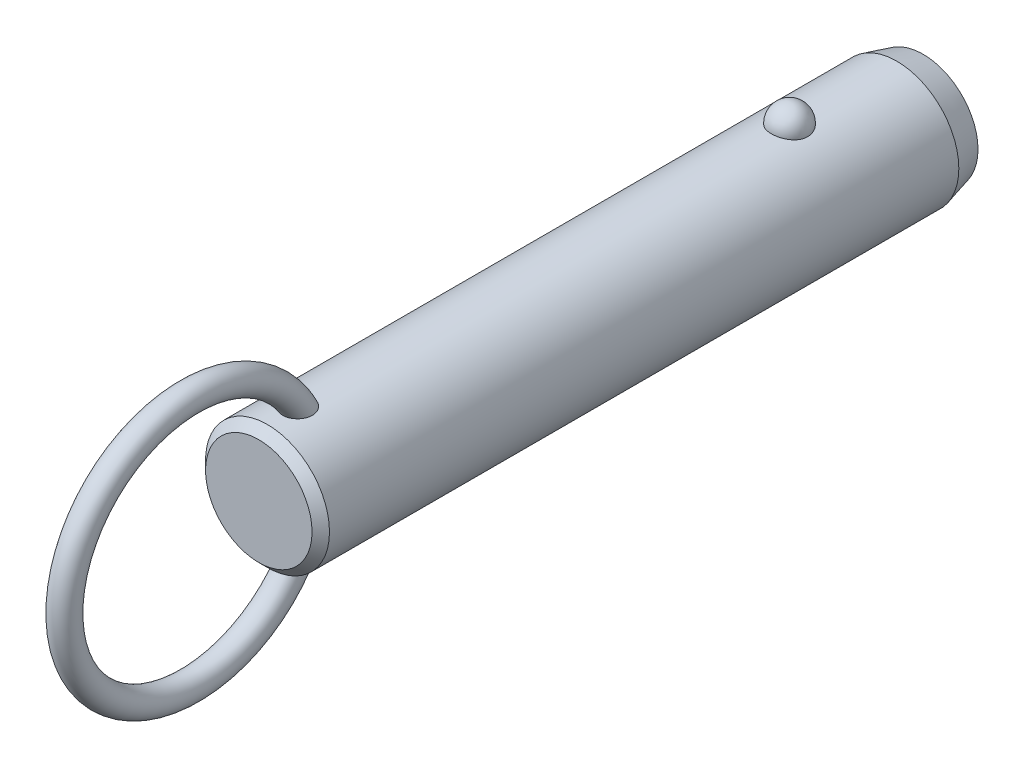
ISO-10303-21;
HEADER;
FILE_DESCRIPTION(('STEP AP214'),'2;1');
FILE_NAME('part.step','',(''),(''),'','','');
FILE_SCHEMA(('AUTOMOTIVE_DESIGN { 1 0 10303 214 1 1 1 1 }'));
ENDSEC;
DATA;
#1=APPLICATION_CONTEXT('core data for automotive mechanical design processes');
#2=APPLICATION_PROTOCOL_DEFINITION('international standard','automotive_design',2000,#1);
#3=PRODUCT_CONTEXT('',#1,'mechanical');
#4=PRODUCT('Part','Part','',(#3));
#5=PRODUCT_RELATED_PRODUCT_CATEGORY('part','',(#4));
#6=PRODUCT_DEFINITION_FORMATION('','',#4);
#7=PRODUCT_DEFINITION_CONTEXT('part definition',#1,'design');
#8=PRODUCT_DEFINITION('design','',#6,#7);
#9=PRODUCT_DEFINITION_SHAPE('','',#8);
#10=(LENGTH_UNIT() NAMED_UNIT(*) SI_UNIT(.MILLI.,.METRE.));
#11=(NAMED_UNIT(*) PLANE_ANGLE_UNIT() SI_UNIT($,.RADIAN.));
#12=(NAMED_UNIT(*) SI_UNIT($,.STERADIAN.) SOLID_ANGLE_UNIT());
#13=UNCERTAINTY_MEASURE_WITH_UNIT(LENGTH_MEASURE(1.E-05),#10,'distance_accuracy_value','');
#14=(GEOMETRIC_REPRESENTATION_CONTEXT(3) GLOBAL_UNCERTAINTY_ASSIGNED_CONTEXT((#13)) GLOBAL_UNIT_ASSIGNED_CONTEXT((#10,
#11,#12)) REPRESENTATION_CONTEXT('',''));
#15=CARTESIAN_POINT('',(0.,0.,0.));
#16=DIRECTION('',(0.,0.,1.));
#17=DIRECTION('',(1.,0.,0.));
#18=AXIS2_PLACEMENT_3D('',#15,#16,#17);
#19=CARTESIAN_POINT('',(0.,0.,50.8));
#20=DIRECTION('',(0.,0.,-1.));
#21=DIRECTION('',(-1.,0.,0.));
#22=AXIS2_PLACEMENT_3D('',#19,#20,#21);
#23=CYLINDRICAL_SURFACE('',#22,7.1);
#24=CARTESIAN_POINT('',(2.0769088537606,6.78943661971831,-2.1));
#25=CARTESIAN_POINT('',(2.07690739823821,6.78943796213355,-1.98268154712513));
#26=CARTESIAN_POINT('',(2.06738130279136,6.79237331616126,-1.86534506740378));
#27=CARTESIAN_POINT('',(2.0295040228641,6.8037853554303,-1.63400788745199));
#28=CARTESIAN_POINT('',(2.00114757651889,6.81226358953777,-1.52000812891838));
#29=CARTESIAN_POINT('',(1.92632025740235,6.83379798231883,-1.29863433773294));
#30=CARTESIAN_POINT('',(1.87985726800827,6.84685214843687,-1.19125744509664));
#31=CARTESIAN_POINT('',(1.76995205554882,6.87608091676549,-0.98604657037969));
#32=CARTESIAN_POINT('',(1.70650980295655,6.8922555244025,-0.88821260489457));
#33=CARTESIAN_POINT('',(1.5638119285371,6.92602930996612,-0.704242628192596));
#34=CARTESIAN_POINT('',(1.4844714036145,6.94363582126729,-0.618173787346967));
#35=CARTESIAN_POINT('',(1.31221746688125,6.97823658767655,-0.460740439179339));
#36=CARTESIAN_POINT('',(1.21930409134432,6.99523084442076,-0.389375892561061));
#37=CARTESIAN_POINT('',(1.02268781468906,7.02666176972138,-0.263547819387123));
#38=CARTESIAN_POINT('',(0.91902009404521,7.04110638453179,-0.209031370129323));
#39=CARTESIAN_POINT('',(0.703548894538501,7.06588726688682,-0.118163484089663));
#40=CARTESIAN_POINT('',(0.591746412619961,7.07622403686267,-0.0818098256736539));
#41=CARTESIAN_POINT('',(0.365557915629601,7.09147068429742,-0.0288711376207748));
#42=CARTESIAN_POINT('',(0.251267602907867,7.09648447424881,-0.0119070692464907));
#43=CARTESIAN_POINT('',(0.0213499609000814,7.10089837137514,0.00304925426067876));
#44=CARTESIAN_POINT('',(-0.0942772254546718,7.10029907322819,0.00104351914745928));
#45=CARTESIAN_POINT('',(-0.321651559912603,7.09360829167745,-0.0216931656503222));
#46=CARTESIAN_POINT('',(-0.433431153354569,7.08760388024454,-0.0421272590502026));
#47=CARTESIAN_POINT('',(-0.651862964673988,7.07086131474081,-0.100729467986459));
#48=CARTESIAN_POINT('',(-0.758515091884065,7.06012307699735,-0.138897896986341));
#49=CARTESIAN_POINT('',(-0.964449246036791,7.03496097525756,-0.232213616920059));
#50=CARTESIAN_POINT('',(-1.06368095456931,7.02051445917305,-0.287465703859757));
#51=CARTESIAN_POINT('',(-1.25145353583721,6.98948740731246,-0.413383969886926));
#52=CARTESIAN_POINT('',(-1.33999321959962,6.97290663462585,-0.48405186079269));
#53=CARTESIAN_POINT('',(-1.50591604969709,6.93898770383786,-0.640594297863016));
#54=CARTESIAN_POINT('',(-1.58302488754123,6.92164094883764,-0.726757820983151));
#55=CARTESIAN_POINT('',(-1.72189320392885,6.8884103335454,-0.91092752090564));
#56=CARTESIAN_POINT('',(-1.78365144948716,6.87252659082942,-1.008934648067));
#57=CARTESIAN_POINT('',(-1.89101272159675,6.84377189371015,-1.21549497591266));
#58=CARTESIAN_POINT('',(-1.93639553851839,6.83094274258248,-1.32416860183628));
#59=CARTESIAN_POINT('',(-2.00874275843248,6.81002070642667,-1.54791500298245));
#60=CARTESIAN_POINT('',(-2.03570774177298,6.80192767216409,-1.66298757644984));
#61=CARTESIAN_POINT('',(-2.07047276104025,6.7914266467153,-1.89571453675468));
#62=CARTESIAN_POINT('',(-2.07835878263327,6.78899315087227,-2.01335491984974));
#63=CARTESIAN_POINT('',(-2.07502083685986,6.79001409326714,-2.24833570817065));
#64=CARTESIAN_POINT('',(-2.06379746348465,6.7934683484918,-2.36567612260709));
#65=CARTESIAN_POINT('',(-2.02263913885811,6.80583442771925,-2.59603194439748));
#66=CARTESIAN_POINT('',(-1.99281127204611,6.81471501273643,-2.70906820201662));
#67=CARTESIAN_POINT('',(-1.91526639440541,6.83691232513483,-2.92836575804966));
#68=CARTESIAN_POINT('',(-1.8675486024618,6.85022924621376,-3.03462676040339));
#69=CARTESIAN_POINT('',(-1.75504492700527,6.87991336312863,-3.23806487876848));
#70=CARTESIAN_POINT('',(-1.69015924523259,6.89629822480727,-3.33518422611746));
#71=CARTESIAN_POINT('',(-1.54505404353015,6.93024852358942,-3.51697105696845));
#72=CARTESIAN_POINT('',(-1.46483385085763,6.94781401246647,-3.60163799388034));
#73=CARTESIAN_POINT('',(-1.29071406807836,6.98225977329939,-3.75654119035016));
#74=CARTESIAN_POINT('',(-1.19675650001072,6.99913673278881,-3.82671308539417));
#75=CARTESIAN_POINT('',(-0.997940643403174,7.03023618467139,-3.9501837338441));
#76=CARTESIAN_POINT('',(-0.89308318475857,7.04445887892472,-4.00348377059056));
#77=CARTESIAN_POINT('',(-0.676902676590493,7.06848365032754,-4.09107242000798));
#78=CARTESIAN_POINT('',(-0.565686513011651,7.0783430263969,-4.12560889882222));
#79=CARTESIAN_POINT('',(-0.338739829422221,7.09282534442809,-4.17575450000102));
#80=CARTESIAN_POINT('',(-0.223009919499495,7.09744899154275,-4.19136617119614));
#81=CARTESIAN_POINT('',(0.00707628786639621,7.10090930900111,-4.20307965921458));
#82=CARTESIAN_POINT('',(0.121410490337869,7.09986531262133,-4.19958377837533));
#83=CARTESIAN_POINT('',(0.347815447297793,7.092380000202,-4.17411564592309));
#84=CARTESIAN_POINT('',(0.459886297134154,7.08593891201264,-4.15214417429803));
#85=CARTESIAN_POINT('',(0.678084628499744,7.06838983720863,-4.09049562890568));
#86=CARTESIAN_POINT('',(0.784237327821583,7.05730369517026,-4.05090137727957));
#87=CARTESIAN_POINT('',(0.988305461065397,7.03163139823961,-3.95511447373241));
#88=CARTESIAN_POINT('',(1.08622031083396,7.01704499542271,-3.89892064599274));
#89=CARTESIAN_POINT('',(1.27284490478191,6.98562668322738,-3.77035541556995));
#90=CARTESIAN_POINT('',(1.36137372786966,6.96876135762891,-3.69772964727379));
#91=CARTESIAN_POINT('',(1.52509486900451,6.93477412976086,-3.53878279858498));
#92=CARTESIAN_POINT('',(1.60028496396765,6.91765218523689,-3.45245943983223));
#93=CARTESIAN_POINT('',(1.73681688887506,6.88465753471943,-3.26658774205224));
#94=CARTESIAN_POINT('',(1.79785966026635,6.86881574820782,-3.16681408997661));
#95=CARTESIAN_POINT('',(1.90265327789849,6.84053157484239,-2.95814408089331));
#96=CARTESIAN_POINT('',(1.94640861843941,6.82808830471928,-2.84925010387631));
#97=CARTESIAN_POINT('',(2.01274378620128,6.80881460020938,-2.63454318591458));
#98=CARTESIAN_POINT('',(2.03676193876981,6.80160856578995,-2.52920574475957));
#99=CARTESIAN_POINT('',(2.06884490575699,6.79191902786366,-2.3159172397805));
#100=CARTESIAN_POINT('',(2.07691019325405,6.78943538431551,-2.20796625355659));
#101=CARTESIAN_POINT('',(2.0769088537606,6.78943661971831,-2.1));
#102=B_SPLINE_CURVE_WITH_KNOTS('',3,(#24,#25,#26,#27,#28,#29,#30,#31,#32,#33,#34,#35,#36,#37,
#38,#39,#40,#41,#42,#43,#44,#45,#46,#47,#48,#49,#50,#51,#52,#53,#54,#55,#56,#57,#58,#59,#60,#61,
#62,#63,#64,#65,#66,#67,#68,#69,#70,#71,#72,#73,#74,#75,#76,#77,#78,#79,#80,#81,#82,#83,#84,#85,
#86,#87,#88,#89,#90,#91,#92,#93,#94,#95,#96,#97,#98,#99,#100,#101),.UNSPECIFIED.,.T.,.F.,(4,2,2,
2,2,2,2,2,2,2,2,2,2,2,2,2,2,2,2,2,2,2,2,2,2,2,2,2,2,2,2,2,2,2,2,2,2,2,4),(0.,0.351568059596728,
0.703234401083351,1.05474780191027,1.40626181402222,1.75970563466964,2.11314851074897,
2.4654696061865,2.81774759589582,3.16301449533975,3.50824481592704,3.84801136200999,
4.18778391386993,4.52968352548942,4.87162112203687,5.22076181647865,5.56993054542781,
5.92363364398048,6.27732559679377,6.62942052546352,6.98150450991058,7.33158042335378,
7.68167162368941,8.03384443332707,8.38603269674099,8.73975272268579,9.09344583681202,
9.44234545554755,9.79119807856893,10.1327344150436,10.4742563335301,10.8141898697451,
11.1541474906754,11.4997793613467,11.8454687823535,12.1979079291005,12.5502553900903,
12.8738073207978,13.1973496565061),.UNSPECIFIED.);
#103=CARTESIAN_POINT('',(2.0769088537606,6.78943661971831,-2.1));
#104=VERTEX_POINT('',#103);
#105=EDGE_CURVE('E41',#104,#104,#102,.T.);
#106=ORIENTED_EDGE('',*,*,#105,.T.);
#107=EDGE_LOOP('',(#106));
#108=FACE_BOUND('',#107,.T.);
#109=CARTESIAN_POINT('',(0.,0.,57.72));
#110=DIRECTION('',(0.,0.,1.));
#111=DIRECTION('',(1.,0.,0.));
#112=AXIS2_PLACEMENT_3D('',#109,#110,#111);
#113=CIRCLE('',#112,7.1);
#114=CARTESIAN_POINT('',(7.1,0.,57.72));
#115=VERTEX_POINT('',#114);
#116=EDGE_CURVE('E10',#115,#115,#113,.F.);
#117=ORIENTED_EDGE('',*,*,#116,.T.);
#118=EDGE_LOOP('',(#117));
#119=FACE_BOUND('',#118,.T.);
#120=CARTESIAN_POINT('',(-0.429539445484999,-7.08699541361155,52.5429212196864));
#121=CARTESIAN_POINT('',(-0.508331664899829,-7.08221999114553,52.5668764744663));
#122=CARTESIAN_POINT('',(-0.585039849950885,-7.07624016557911,52.5974570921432));
#123=CARTESIAN_POINT('',(-0.732082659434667,-7.06254296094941,52.6710242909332));
#124=CARTESIAN_POINT('',(-0.802417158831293,-7.05482554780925,52.7140111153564));
#125=CARTESIAN_POINT('',(-0.934722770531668,-7.03851844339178,52.8111135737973));
#126=CARTESIAN_POINT('',(-0.99670020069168,-7.02992941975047,52.8652207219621));
#127=CARTESIAN_POINT('',(-1.11079942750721,-7.01280697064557,52.9829676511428));
#128=CARTESIAN_POINT('',(-1.16292136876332,-7.00427354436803,53.0466072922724));
#129=CARTESIAN_POINT('',(-1.25705660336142,-6.98799959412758,53.1826870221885));
#130=CARTESIAN_POINT('',(-1.29888032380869,-6.98027525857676,53.2552598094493));
#131=CARTESIAN_POINT('',(-1.37069920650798,-6.96652886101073,53.4061686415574));
#132=CARTESIAN_POINT('',(-1.40069157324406,-6.96050720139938,53.4845060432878));
#133=CARTESIAN_POINT('',(-1.45043507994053,-6.95031881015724,53.6501903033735));
#134=CARTESIAN_POINT('',(-1.46937115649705,-6.94630231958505,53.7377897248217));
#135=CARTESIAN_POINT('',(-1.49424917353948,-6.94099239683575,53.9148714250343));
#136=CARTESIAN_POINT('',(-1.50018601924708,-6.93970003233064,54.0043544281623));
#137=CARTESIAN_POINT('',(-1.49978214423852,-6.93978815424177,54.1940607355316));
#138=CARTESIAN_POINT('',(-1.49187639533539,-6.94150934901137,54.294279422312));
#139=CARTESIAN_POINT('',(-1.46177925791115,-6.94790814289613,54.4924798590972));
#140=CARTESIAN_POINT('',(-1.43957541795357,-6.95258831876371,54.590459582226));
#141=CARTESIAN_POINT('',(-1.37783293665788,-6.96510647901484,54.7953629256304));
#142=CARTESIAN_POINT('',(-1.33634073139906,-6.97328848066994,54.9016801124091));
#143=CARTESIAN_POINT('',(-1.23686994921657,-6.99161706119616,55.1061777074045));
#144=CARTESIAN_POINT('',(-1.17889192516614,-7.00176357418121,55.2043583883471));
#145=CARTESIAN_POINT('',(-1.0587512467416,-7.02082898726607,55.372374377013));
#146=CARTESIAN_POINT('',(-0.999247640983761,-7.02963746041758,55.4441230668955));
#147=CARTESIAN_POINT('',(-0.869494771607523,-7.04686074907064,55.5771959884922));
#148=CARTESIAN_POINT('',(-0.799263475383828,-7.05527619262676,55.6385372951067));
#149=CARTESIAN_POINT('',(-0.665408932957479,-7.06899457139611,55.7351316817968));
#150=CARTESIAN_POINT('',(-0.603817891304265,-7.07457275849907,55.7731512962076));
#151=CARTESIAN_POINT('',(-0.475172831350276,-7.08437420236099,55.8387581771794));
#152=CARTESIAN_POINT('',(-0.408123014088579,-7.08859848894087,55.8663533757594));
#153=CARTESIAN_POINT('',(-0.269431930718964,-7.09522749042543,55.9092569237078));
#154=CARTESIAN_POINT('',(-0.197757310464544,-7.09761688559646,55.9244618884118));
#155=CARTESIAN_POINT('',(-0.052784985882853,-7.10017268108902,55.9407168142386));
#156=CARTESIAN_POINT('',(0.0205115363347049,-7.10034065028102,55.9417767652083));
#157=CARTESIAN_POINT('',(0.156426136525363,-7.09855986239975,55.9304619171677));
#158=CARTESIAN_POINT('',(0.219199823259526,-7.09688191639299,55.9198060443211));
#159=CARTESIAN_POINT('',(0.342134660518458,-7.09201880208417,55.8885379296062));
#160=CARTESIAN_POINT('',(0.402295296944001,-7.08883333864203,55.8679237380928));
#161=CARTESIAN_POINT('',(0.520687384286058,-7.08113868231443,55.8172125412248));
#162=CARTESIAN_POINT('',(0.578791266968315,-7.07658958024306,55.7868272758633));
#163=CARTESIAN_POINT('',(0.690173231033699,-7.06659708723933,55.7183678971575));
#164=CARTESIAN_POINT('',(0.743447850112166,-7.061153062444,55.6802883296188));
#165=CARTESIAN_POINT('',(0.870947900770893,-7.04680292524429,55.5765929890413));
#166=CARTESIAN_POINT('',(0.941828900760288,-7.0375580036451,55.5068972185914));
#167=CARTESIAN_POINT('',(1.07136606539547,-7.01900793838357,55.3569450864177));
#168=CARTESIAN_POINT('',(1.13000013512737,-7.00970271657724,55.2766700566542));
#169=CARTESIAN_POINT('',(1.23579584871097,-6.99183327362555,55.1068997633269));
#170=CARTESIAN_POINT('',(1.28274271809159,-6.98328455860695,55.0172696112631));
#171=CARTESIAN_POINT('',(1.36351442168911,-6.96796352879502,54.8321763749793));
#172=CARTESIAN_POINT('',(1.39733971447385,-6.96119115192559,54.7367134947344));
#173=CARTESIAN_POINT('',(1.45579181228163,-6.94922464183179,54.5253092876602));
#174=CARTESIAN_POINT('',(1.47790145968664,-6.94449000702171,54.408631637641));
#175=CARTESIAN_POINT('',(1.50168752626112,-6.93938731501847,54.1730153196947));
#176=CARTESIAN_POINT('',(1.50336085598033,-6.93901991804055,54.0540763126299));
#177=CARTESIAN_POINT('',(1.48486516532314,-6.9430010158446,53.8236079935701));
#178=CARTESIAN_POINT('',(1.46573441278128,-6.9471253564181,53.7119958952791));
#179=CARTESIAN_POINT('',(1.40606892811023,-6.95944667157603,53.4948868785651));
#180=CARTESIAN_POINT('',(1.3655644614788,-6.96763788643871,53.3893815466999));
#181=CARTESIAN_POINT('',(1.27082700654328,-6.98548038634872,53.2042879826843));
#182=CARTESIAN_POINT('',(1.21949810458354,-6.99473841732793,53.1231719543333));
#183=CARTESIAN_POINT('',(1.10242050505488,-7.01414069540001,52.9722278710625));
#184=CARTESIAN_POINT('',(1.03668119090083,-7.02428436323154,52.9023925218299));
#185=CARTESIAN_POINT('',(0.900559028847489,-7.04295285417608,52.7835735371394));
#186=CARTESIAN_POINT('',(0.831428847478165,-7.05153466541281,52.7331573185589));
#187=CARTESIAN_POINT('',(0.685291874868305,-7.06723150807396,52.6451429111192));
#188=CARTESIAN_POINT('',(0.60828720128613,-7.0743469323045,52.6075412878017));
#189=CARTESIAN_POINT('',(0.451878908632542,-7.08602232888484,52.5474915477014));
#190=CARTESIAN_POINT('',(0.372686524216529,-7.09067127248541,52.5245088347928));
#191=CARTESIAN_POINT('',(0.211477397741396,-7.09730788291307,52.4920357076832));
#192=CARTESIAN_POINT('',(0.129460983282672,-7.09929585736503,52.4825437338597));
#193=CARTESIAN_POINT('',(-0.0332905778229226,-7.10037858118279,52.4773517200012));
#194=CARTESIAN_POINT('',(-0.1140163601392,-7.09953334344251,52.4813656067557));
#195=CARTESIAN_POINT('',(-0.273670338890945,-7.09517338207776,52.5024540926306));
#196=CARTESIAN_POINT('',(-0.352598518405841,-7.09165863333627,52.5195288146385));
#197=CARTESIAN_POINT('',(-0.429539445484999,-7.08699541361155,52.5429212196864));
#198=B_SPLINE_CURVE_WITH_KNOTS('',3,(#120,#121,#122,#123,#124,#125,#126,#127,#128,#129,#130,
#131,#132,#133,#134,#135,#136,#137,#138,#139,#140,#141,#142,#143,#144,#145,#146,#147,#148,#149,
#150,#151,#152,#153,#154,#155,#156,#157,#158,#159,#160,#161,#162,#163,#164,#165,#166,#167,#168,
#169,#170,#171,#172,#173,#174,#175,#176,#177,#178,#179,#180,#181,#182,#183,#184,#185,#186,#187,
#188,#189,#190,#191,#192,#193,#194,#195,#196,#197),.UNSPECIFIED.,.T.,.F.,(4,2,2,2,2,2,2,2,2,2,2,
2,2,2,2,2,2,2,2,2,2,2,2,2,2,2,2,2,2,2,2,2,2,2,2,2,2,2,4),(0.,0.247183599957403,
0.494372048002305,0.741372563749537,0.988369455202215,1.23962059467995,1.49093106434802,
1.75897818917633,2.02713035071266,2.32758265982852,2.62829697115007,2.9700873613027,
3.31186629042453,3.5917531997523,3.87117637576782,4.08813841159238,4.30493502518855,
4.52352259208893,4.7419557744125,4.93215328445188,5.12238804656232,5.31884850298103,
5.51544871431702,5.81332317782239,6.11173048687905,6.41527266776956,6.71880423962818,
7.07358156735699,7.42841252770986,7.76631485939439,8.10373999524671,8.39142246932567,
8.67891817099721,8.93560332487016,9.19221962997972,9.43881106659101,9.68537399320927,
9.92674752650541,10.1681233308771),.UNSPECIFIED.);
#199=CARTESIAN_POINT('',(-0.429539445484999,-7.08699541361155,52.5429212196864));
#200=VERTEX_POINT('',#199);
#201=EDGE_CURVE('E60',#200,#200,#198,.T.);
#202=ORIENTED_EDGE('',*,*,#201,.T.);
#203=EDGE_LOOP('',(#202));
#204=FACE_BOUND('',#203,.T.);
#205=CARTESIAN_POINT('',(-0.429539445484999,7.08699541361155,52.5429212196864));
#206=CARTESIAN_POINT('',(-0.351665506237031,7.09171429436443,52.5192469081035));
#207=CARTESIAN_POINT('',(-0.271733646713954,7.09525896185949,52.5020369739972));
#208=CARTESIAN_POINT('',(-0.110026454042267,7.09960839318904,52.4810059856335));
#209=CARTESIAN_POINT('',(-0.0282502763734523,7.10041187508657,52.477191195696));
#210=CARTESIAN_POINT('',(0.134782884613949,7.09918849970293,52.483059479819));
#211=CARTESIAN_POINT('',(0.216039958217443,7.09716214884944,52.4927401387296));
#212=CARTESIAN_POINT('',(0.375730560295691,7.09050177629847,52.5253471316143));
#213=CARTESIAN_POINT('',(0.454164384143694,7.08586802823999,52.5482720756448));
#214=CARTESIAN_POINT('',(0.606025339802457,7.07449911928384,52.606771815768));
#215=CARTESIAN_POINT('',(0.679451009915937,7.06776334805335,52.6423502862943));
#216=CARTESIAN_POINT('',(0.819234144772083,7.05292866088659,52.7251753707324));
#217=CARTESIAN_POINT('',(0.885591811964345,7.04482978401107,52.7724216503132));
#218=CARTESIAN_POINT('',(1.00993211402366,7.02808709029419,52.8775902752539));
#219=CARTESIAN_POINT('',(1.06785399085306,7.01943990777,52.935583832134));
#220=CARTESIAN_POINT('',(1.17342527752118,7.00256662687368,53.0603013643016));
#221=CARTESIAN_POINT('',(1.22107408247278,6.99434055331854,53.1270258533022));
#222=CARTESIAN_POINT('',(1.30652927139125,6.97889183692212,53.2693622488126));
#223=CARTESIAN_POINT('',(1.34399711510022,6.97170674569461,53.3451808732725));
#224=CARTESIAN_POINT('',(1.40682616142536,6.95930080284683,53.5018100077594));
#225=CARTESIAN_POINT('',(1.43218374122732,6.95408053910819,53.5826220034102));
#226=CARTESIAN_POINT('',(1.47246409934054,6.94566853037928,53.7535314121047));
#227=CARTESIAN_POINT('',(1.48642590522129,6.9426653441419,53.8438630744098));
#228=CARTESIAN_POINT('',(1.5011410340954,6.93949744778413,54.025619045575));
#229=CARTESIAN_POINT('',(1.50188917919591,6.93933385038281,54.1170437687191));
#230=CARTESIAN_POINT('',(1.49030464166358,6.94183245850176,54.3108438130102));
#231=CARTESIAN_POINT('',(1.47627413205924,6.94486147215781,54.413112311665));
#232=CARTESIAN_POINT('',(1.43356351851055,6.95380194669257,54.6144719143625));
#233=CARTESIAN_POINT('',(1.4048676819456,6.95971650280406,54.7135594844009));
#234=CARTESIAN_POINT('',(1.32908750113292,6.97461208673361,54.9189087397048));
#235=CARTESIAN_POINT('',(1.28011435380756,6.98388945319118,55.0244566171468));
#236=CARTESIAN_POINT('',(1.16520357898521,7.00397743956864,55.2257604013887));
#237=CARTESIAN_POINT('',(1.09927694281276,7.01478706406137,55.3215225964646));
#238=CARTESIAN_POINT('',(0.969361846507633,7.03373936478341,55.4767565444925));
#239=CARTESIAN_POINT('',(0.909042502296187,7.04187023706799,55.5393032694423));
#240=CARTESIAN_POINT('',(0.779178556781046,7.05741732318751,55.6540535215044));
#241=CARTESIAN_POINT('',(0.709649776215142,7.06483472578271,55.7062744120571));
#242=CARTESIAN_POINT('',(0.576854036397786,7.0767751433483,55.7881138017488));
#243=CARTESIAN_POINT('',(0.515118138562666,7.08158033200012,55.8201641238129));
#244=CARTESIAN_POINT('',(0.38712798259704,7.08972701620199,55.8737656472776));
#245=CARTESIAN_POINT('',(0.320877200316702,7.09306962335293,55.8953248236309));
#246=CARTESIAN_POINT('',(0.185041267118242,7.09791507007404,55.9264005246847));
#247=CARTESIAN_POINT('',(0.115437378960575,7.09940591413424,55.9358385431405));
#248=CARTESIAN_POINT('',(-0.0243157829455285,7.10030171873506,55.9415226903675));
#249=CARTESIAN_POINT('',(-0.0944648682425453,7.0997073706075,55.9377731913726));
#250=CARTESIAN_POINT('',(-0.225713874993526,7.09668414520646,55.9185081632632));
#251=CARTESIAN_POINT('',(-0.287006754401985,7.09444865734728,55.9042323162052));
#252=CARTESIAN_POINT('',(-0.406555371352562,7.08860360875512,55.8663685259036));
#253=CARTESIAN_POINT('',(-0.464809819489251,7.08499346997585,55.8427766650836));
#254=CARTESIAN_POINT('',(-0.594955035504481,7.07541654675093,55.7789232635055));
#255=CARTESIAN_POINT('',(-0.66538935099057,7.06906574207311,55.735753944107));
#256=CARTESIAN_POINT('',(-0.798242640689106,7.05530261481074,55.638587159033));
#257=CARTESIAN_POINT('',(-0.860645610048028,7.0478882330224,55.5845686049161));
#258=CARTESIAN_POINT('',(-0.994249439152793,7.03045217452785,55.4509965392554));
#259=CARTESIAN_POINT('',(-1.06260129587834,7.02030745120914,55.3686143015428));
#260=CARTESIAN_POINT('',(-1.18502045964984,7.00068382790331,55.193843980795));
#261=CARTESIAN_POINT('',(-1.23907684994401,6.99120544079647,55.101448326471));
#262=CARTESIAN_POINT('',(-1.33335589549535,6.97384343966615,54.9080085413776));
#263=CARTESIAN_POINT('',(-1.37336138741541,6.96598557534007,54.8068564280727));
#264=CARTESIAN_POINT('',(-1.43770677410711,6.9529905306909,54.5995046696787));
#265=CARTESIAN_POINT('',(-1.46204473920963,6.94785368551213,54.49330440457));
#266=CARTESIAN_POINT('',(-1.49537533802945,6.94076296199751,54.2682317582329));
#267=CARTESIAN_POINT('',(-1.50273564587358,6.93914842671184,54.1490975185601));
#268=CARTESIAN_POINT('',(-1.4954555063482,6.94072368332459,53.9114703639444));
#269=CARTESIAN_POINT('',(-1.48082914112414,6.94391040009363,53.7929770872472));
#270=CARTESIAN_POINT('',(-1.43076401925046,6.95438579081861,53.5734325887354));
#271=CARTESIAN_POINT('',(-1.39762227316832,6.96121852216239,53.4718413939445));
#272=CARTESIAN_POINT('',(-1.31211274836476,6.97783941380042,53.2773513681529));
#273=CARTESIAN_POINT('',(-1.2597660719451,6.98762432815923,53.1844431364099));
#274=CARTESIAN_POINT('',(-1.14583073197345,7.00713153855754,53.0241601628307));
#275=CARTESIAN_POINT('',(-1.08665947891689,7.01665982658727,52.9550351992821));
#276=CARTESIAN_POINT('',(-0.956606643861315,7.03556646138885,52.8288786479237));
#277=CARTESIAN_POINT('',(-0.885737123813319,7.04494495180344,52.7718347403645));
#278=CARTESIAN_POINT('',(-0.751558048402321,7.06035735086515,52.6831004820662));
#279=CARTESIAN_POINT('',(-0.690120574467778,7.0666695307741,52.6485932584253));
#280=CARTESIAN_POINT('',(-0.562815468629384,7.07794609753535,52.5887507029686));
#281=CARTESIAN_POINT('',(-0.496948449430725,7.08291067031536,52.5634141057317));
#282=CARTESIAN_POINT('',(-0.429539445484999,7.08699541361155,52.5429212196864));
#283=B_SPLINE_CURVE_WITH_KNOTS('',3,(#205,#206,#207,#208,#209,#210,#211,#212,#213,#214,#215,
#216,#217,#218,#219,#220,#221,#222,#223,#224,#225,#226,#227,#228,#229,#230,#231,#232,#233,#234,
#235,#236,#237,#238,#239,#240,#241,#242,#243,#244,#245,#246,#247,#248,#249,#250,#251,#252,#253,
#254,#255,#256,#257,#258,#259,#260,#261,#262,#263,#264,#265,#266,#267,#268,#269,#270,#271,#272,
#273,#274,#275,#276,#277,#278,#279,#280,#281,#282),.UNSPECIFIED.,.T.,.F.,(4,2,2,2,2,2,2,2,2,2,2,
2,2,2,2,2,2,2,2,2,2,2,2,2,2,2,2,2,2,2,2,2,2,2,2,2,2,2,4),(0.,0.244335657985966,
0.488785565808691,0.733191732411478,0.977572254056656,1.22202379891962,1.46646834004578,
1.71259457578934,1.9587352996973,2.21226768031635,2.46587585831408,2.7391381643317,
3.01250754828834,3.32109936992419,3.63002293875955,3.97863512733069,4.32702187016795,
4.58793945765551,4.84841449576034,5.05676704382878,5.26496096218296,5.47449661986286,
5.68396281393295,5.8720544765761,6.06022532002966,6.30743751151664,6.55513496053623,
6.87602468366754,7.19715875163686,7.52305774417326,7.84899686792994,8.20516155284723,
8.56109821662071,8.8804008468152,9.19935367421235,9.47236282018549,9.74509220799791,
9.95662250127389,10.1681235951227),.UNSPECIFIED.);
#284=CARTESIAN_POINT('',(-0.429539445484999,7.08699541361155,52.5429212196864));
#285=VERTEX_POINT('',#284);
#286=EDGE_CURVE('E67',#285,#285,#283,.T.);
#287=ORIENTED_EDGE('',*,*,#286,.T.);
#288=EDGE_LOOP('',(#287));
#289=FACE_BOUND('',#288,.T.);
#290=CARTESIAN_POINT('',(0.,0.,-14.3999999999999));
#291=DIRECTION('',(0.,0.,-1.));
#292=DIRECTION('',(-1.,0.,0.));
#293=AXIS2_PLACEMENT_3D('',#290,#291,#292);
#294=CIRCLE('',#293,7.1);
#295=CARTESIAN_POINT('',(7.1,0.,-14.3999999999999));
#296=VERTEX_POINT('',#295);
#297=EDGE_CURVE('E57',#296,#296,#294,.F.);
#298=ORIENTED_EDGE('',*,*,#297,.T.);
#299=EDGE_LOOP('',(#298));
#300=FACE_BOUND('',#299,.T.);
#301=ADVANCED_FACE('F37',(#108,#119,#204,#289,#300),#23,.T.);
#302=CARTESIAN_POINT('',(0.,0.,-17.4));
#303=DIRECTION('',(0.,0.,-1.));
#304=DIRECTION('',(-1.,0.,0.));
#305=AXIS2_PLACEMENT_3D('',#302,#303,#304);
#306=PLANE('',#305);
#307=CARTESIAN_POINT('',(0.,0.,-17.4));
#308=DIRECTION('',(0.,0.,-1.));
#309=DIRECTION('',(-1.,0.,0.));
#310=AXIS2_PLACEMENT_3D('',#307,#308,#309);
#311=CIRCLE('',#310,6.29615242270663);
#312=CARTESIAN_POINT('',(6.29615242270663,0.,-17.4));
#313=VERTEX_POINT('',#312);
#314=EDGE_CURVE('E66',#313,#313,#311,.T.);
#315=ORIENTED_EDGE('',*,*,#314,.T.);
#316=EDGE_LOOP('',(#315));
#317=FACE_BOUND('',#316,.T.);
#318=ADVANCED_FACE('F85',(#317),#306,.T.);
#319=CARTESIAN_POINT('',(0.,0.,-17.4));
#320=DIRECTION('',(0.,0.,1.));
#321=DIRECTION('',(1.,0.,0.));
#322=AXIS2_PLACEMENT_3D('',#319,#320,#321);
#323=CONICAL_SURFACE('',#322,6.29615242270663,0.261799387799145);
#324=CARTESIAN_POINT('',(7.1,0.,-14.3999999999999));
#325=CARTESIAN_POINT('',(7.09162658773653,0.,-14.4312499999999));
#326=CARTESIAN_POINT('',(7.08325317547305,0.,-14.4624999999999));
#327=CARTESIAN_POINT('',(7.06650635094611,0.,-14.5249999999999));
#328=CARTESIAN_POINT('',(7.05813293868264,0.,-14.5562499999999));
#329=CARTESIAN_POINT('',(7.04138611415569,0.,-14.6187499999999));
#330=CARTESIAN_POINT('',(7.03301270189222,0.,-14.6499999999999));
#331=CARTESIAN_POINT('',(7.01626587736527,0.,-14.7124999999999));
#332=CARTESIAN_POINT('',(7.0078924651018,0.,-14.7437499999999));
#333=CARTESIAN_POINT('',(6.99114564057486,0.,-14.8062499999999));
#334=CARTESIAN_POINT('',(6.98277222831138,0.,-14.8374999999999));
#335=CARTESIAN_POINT('',(6.96602540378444,0.,-14.8999999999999));
#336=CARTESIAN_POINT('',(6.95765199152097,0.,-14.9312499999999));
#337=CARTESIAN_POINT('',(6.94090516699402,0.,-14.9937499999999));
#338=CARTESIAN_POINT('',(6.93253175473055,0.,-15.0249999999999));
#339=CARTESIAN_POINT('',(6.9157849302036,0.,-15.0874999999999));
#340=CARTESIAN_POINT('',(6.90741151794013,0.,-15.1187499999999));
#341=CARTESIAN_POINT('',(6.89066469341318,0.,-15.1812499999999));
#342=CARTESIAN_POINT('',(6.88229128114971,0.,-15.2124999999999));
#343=CARTESIAN_POINT('',(6.86554445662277,0.,-15.2749999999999));
#344=CARTESIAN_POINT('',(6.85717104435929,0.,-15.3062499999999));
#345=CARTESIAN_POINT('',(6.84042421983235,0.,-15.3687499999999));
#346=CARTESIAN_POINT('',(6.83205080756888,0.,-15.4));
#347=CARTESIAN_POINT('',(6.81530398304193,0.,-15.4625));
#348=CARTESIAN_POINT('',(6.80693057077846,0.,-15.49375));
#349=CARTESIAN_POINT('',(6.79018374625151,0.,-15.55625));
#350=CARTESIAN_POINT('',(6.78181033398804,0.,-15.5875));
#351=CARTESIAN_POINT('',(6.7650635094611,0.,-15.65));
#352=CARTESIAN_POINT('',(6.75669009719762,0.,-15.68125));
#353=CARTESIAN_POINT('',(6.73994327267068,0.,-15.74375));
#354=CARTESIAN_POINT('',(6.7315698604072,0.,-15.775));
#355=CARTESIAN_POINT('',(6.71482303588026,0.,-15.8375));
#356=CARTESIAN_POINT('',(6.70644962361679,0.,-15.86875));
#357=CARTESIAN_POINT('',(6.68970279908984,0.,-15.93125));
#358=CARTESIAN_POINT('',(6.68132938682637,0.,-15.9625));
#359=CARTESIAN_POINT('',(6.66458256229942,0.,-16.025));
#360=CARTESIAN_POINT('',(6.65620915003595,0.,-16.05625));
#361=CARTESIAN_POINT('',(6.639462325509,0.,-16.11875));
#362=CARTESIAN_POINT('',(6.63108891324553,0.,-16.15));
#363=CARTESIAN_POINT('',(6.61434208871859,0.,-16.2125));
#364=CARTESIAN_POINT('',(6.60596867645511,0.,-16.24375));
#365=CARTESIAN_POINT('',(6.58922185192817,0.,-16.30625));
#366=CARTESIAN_POINT('',(6.5808484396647,0.,-16.3375));
#367=CARTESIAN_POINT('',(6.56410161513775,0.,-16.4));
#368=CARTESIAN_POINT('',(6.55572820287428,0.,-16.43125));
#369=CARTESIAN_POINT('',(6.53898137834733,0.,-16.49375));
#370=CARTESIAN_POINT('',(6.53060796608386,0.,-16.525));
#371=CARTESIAN_POINT('',(6.51386114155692,0.,-16.5875));
#372=CARTESIAN_POINT('',(6.50548772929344,0.,-16.61875));
#373=CARTESIAN_POINT('',(6.4887409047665,0.,-16.68125));
#374=CARTESIAN_POINT('',(6.48036749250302,0.,-16.7125));
#375=CARTESIAN_POINT('',(6.46362066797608,0.,-16.775));
#376=CARTESIAN_POINT('',(6.45524725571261,0.,-16.80625));
#377=CARTESIAN_POINT('',(6.43850043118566,0.,-16.86875));
#378=CARTESIAN_POINT('',(6.43012701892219,0.,-16.9));
#379=CARTESIAN_POINT('',(6.41338019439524,0.,-16.9625));
#380=CARTESIAN_POINT('',(6.40500678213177,0.,-16.99375));
#381=CARTESIAN_POINT('',(6.38825995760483,0.,-17.05625));
#382=CARTESIAN_POINT('',(6.37988654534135,0.,-17.0875));
#383=CARTESIAN_POINT('',(6.36313972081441,0.,-17.15));
#384=CARTESIAN_POINT('',(6.35476630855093,0.,-17.18125));
#385=CARTESIAN_POINT('',(6.33801948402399,0.,-17.24375));
#386=CARTESIAN_POINT('',(6.32964607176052,0.,-17.275));
#387=CARTESIAN_POINT('',(6.31289924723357,0.,-17.3375));
#388=CARTESIAN_POINT('',(6.3045258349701,0.,-17.36875));
#389=CARTESIAN_POINT('',(6.29615242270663,0.,-17.4));
#390=B_SPLINE_CURVE_WITH_KNOTS('',3,(#324,#325,#326,#327,#328,#329,#330,#331,#332,#333,#334,
#335,#336,#337,#338,#339,#340,#341,#342,#343,#344,#345,#346,#347,#348,#349,#350,#351,#352,#353,
#354,#355,#356,#357,#358,#359,#360,#361,#362,#363,#364,#365,#366,#367,#368,#369,#370,#371,#372,
#373,#374,#375,#376,#377,#378,#379,#380,#381,#382,#383,#384,#385,#386,#387,#388,#389),
.UNSPECIFIED.,.F.,.F.,(4,2,2,2,2,2,2,2,2,2,2,2,2,2,2,2,2,2,2,2,2,2,2,2,2,2,2,2,2,2,2,2,4),(0.,
0.0970571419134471,0.194114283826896,0.291171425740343,0.38822856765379,0.485285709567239,
0.582342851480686,0.679399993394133,0.77645713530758,0.873514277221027,0.970571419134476,
1.06762856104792,1.16468570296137,1.26174284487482,1.35879998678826,1.45585712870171,
1.55291427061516,1.64997141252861,1.74702855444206,1.8440856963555,1.94114283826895,
2.0381999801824,2.13525712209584,2.23231426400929,2.32937140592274,2.42642854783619,
2.52348568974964,2.62054283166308,2.71759997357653,2.81465711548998,2.91171425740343,
3.00877139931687,3.10582854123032),.UNSPECIFIED.);
#391=EDGE_CURVE('BSEAM83',#296,#313,#390,.T.);
#392=ORIENTED_EDGE('',*,*,#297,.F.);
#393=ORIENTED_EDGE('',*,*,#314,.F.);
#394=ORIENTED_EDGE('',*,*,#391,.T.);
#395=ORIENTED_EDGE('',*,*,#391,.F.);
#396=EDGE_LOOP('',(#392,#394,#393,#395));
#397=FACE_BOUND('',#396,.T.);
#398=ADVANCED_FACE('F83',(#397),#323,.T.);
#399=CARTESIAN_POINT('',(0.,0.,58.72));
#400=DIRECTION('',(0.,0.,1.));
#401=DIRECTION('',(1.,0.,0.));
#402=AXIS2_PLACEMENT_3D('',#399,#400,#401);
#403=PLANE('',#402);
#404=CARTESIAN_POINT('',(0.,0.,58.72));
#405=DIRECTION('',(0.,0.,1.));
#406=DIRECTION('',(1.,0.,0.));
#407=AXIS2_PLACEMENT_3D('',#404,#405,#406);
#408=CIRCLE('',#407,6.09999999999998);
#409=CARTESIAN_POINT('',(6.09999999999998,0.,58.72));
#410=VERTEX_POINT('',#409);
#411=EDGE_CURVE('E50',#410,#410,#408,.T.);
#412=ORIENTED_EDGE('',*,*,#411,.T.);
#413=EDGE_LOOP('',(#412));
#414=FACE_BOUND('',#413,.T.);
#415=ADVANCED_FACE('F77',(#414),#403,.T.);
#416=CARTESIAN_POINT('',(0.,0.,66.65));
#417=DIRECTION('',(1.,0.,0.));
#418=DIRECTION('',(0.,0.,-1.));
#419=AXIS2_PLACEMENT_3D('',#416,#417,#418);
#420=TOROIDAL_SURFACE('',#419,14.35,1.5);
#421=ORIENTED_EDGE('',*,*,#286,.F.);
#422=EDGE_LOOP('',(#421));
#423=FACE_BOUND('',#422,.T.);
#424=ORIENTED_EDGE('',*,*,#201,.F.);
#425=EDGE_LOOP('',(#424));
#426=FACE_BOUND('',#425,.T.);
#427=ADVANCED_FACE('F73',(#423,#426),#420,.T.);
#428=CARTESIAN_POINT('',(0.,0.,58.72));
#429=DIRECTION('',(0.,0.,-1.));
#430=DIRECTION('',(-1.,0.,0.));
#431=AXIS2_PLACEMENT_3D('',#428,#429,#430);
#432=CONICAL_SURFACE('',#431,6.09999999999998,0.78539816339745);
#433=ORIENTED_EDGE('',*,*,#116,.F.);
#434=EDGE_LOOP('',(#433));
#435=FACE_BOUND('',#434,.T.);
#436=ORIENTED_EDGE('',*,*,#411,.F.);
#437=EDGE_LOOP('',(#436));
#438=FACE_BOUND('',#437,.T.);
#439=ADVANCED_FACE('F39',(#435,#438),#432,.T.);
#440=CARTESIAN_POINT('',(0.,7.1,-2.1));
#441=DIRECTION('',(0.,1.,0.));
#442=DIRECTION('',(0.,0.,1.));
#443=AXIS2_PLACEMENT_3D('',#440,#441,#442);
#444=SPHERICAL_SURFACE('',#443,2.10000000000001);
#445=ORIENTED_EDGE('',*,*,#105,.F.);
#446=EDGE_LOOP('',(#445));
#447=FACE_BOUND('',#446,.T.);
#448=ADVANCED_FACE('F79',(#447),#444,.T.);
#449=CLOSED_SHELL('',(#301,#318,#398,#415,#427,#439,#448));
#450=MANIFOLD_SOLID_BREP('B2',#449);
#451=ADVANCED_BREP_SHAPE_REPRESENTATION('',(#18,#450),#14);
#452=SHAPE_DEFINITION_REPRESENTATION(#9,#451);
ENDSEC;
END-ISO-10303-21;
